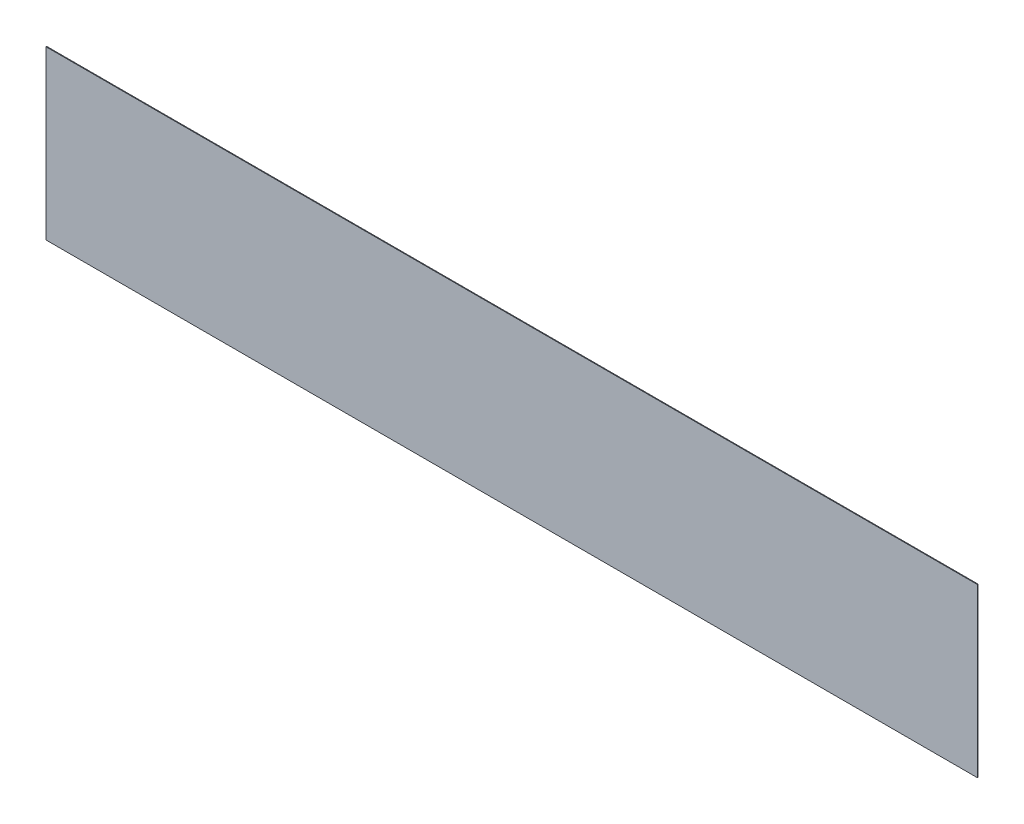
from build123d import *

# Parameters (mm, degrees)
SURFACE_REVOLVE1_1_ANGLE = 359
THICKEN1_T1              = 0.762
SKETCH2_W                = 989.476022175
SKETCH2_H                = 177.8
BOSS_EXTRUDE1_DEPTH      = 0.762


with BuildPart() as body_1:
    # Surface-Revolve1: a surface, the sketch's curves turned about an axis by 359 degrees
    with BuildLine(Plane.XY, mode=Mode.PRIVATE) as surface_revolve1_1_path:
        Line((157.48, 0), (157.48, 177.8))
    surface_revolve1_1 = Shell.revolve(surface_revolve1_1_path.wire(), SURFACE_REVOLVE1_1_ANGLE, Axis((0, 0, 0), (0, 1, 0)))
    add(Solid.thicken(surface_revolve1_1, THICKEN1_T1))


with BuildPart() as body_2:
    # Sketch2 → Boss-Extrude1 (new body)
    with BuildSketch(Plane.XY):
        with Locations((494.738011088, 88.9)):
            Rectangle(SKETCH2_W, SKETCH2_H)
    extrude(amount=BOSS_EXTRUDE1_DEPTH)


solid = body_2.part
